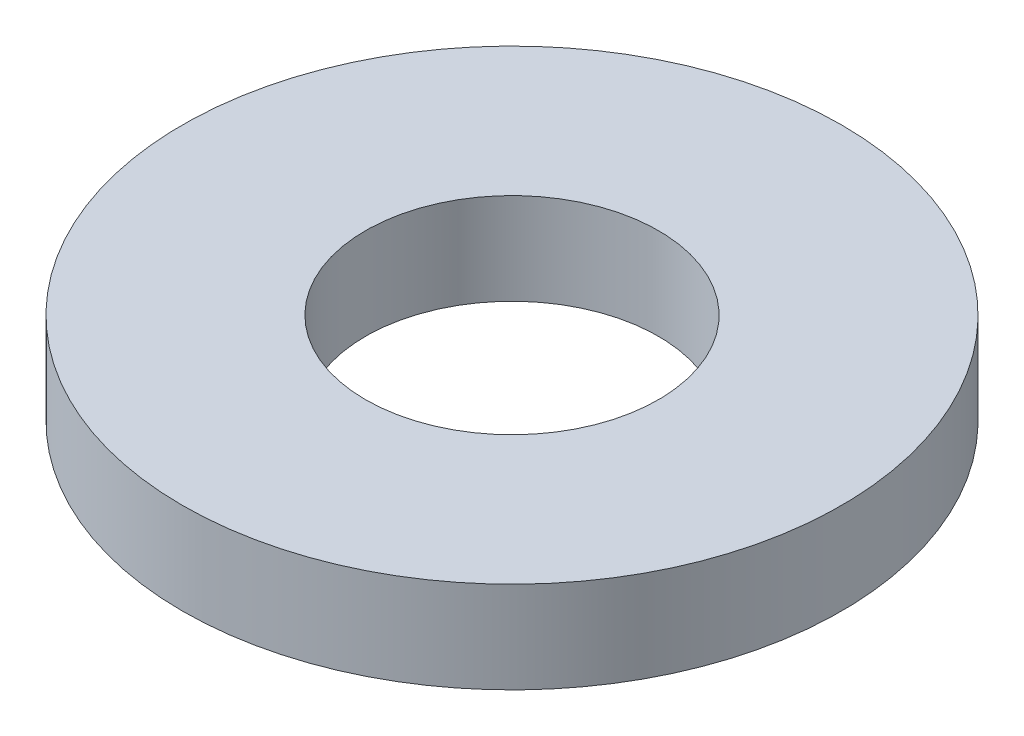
ISO-10303-21;
HEADER;
FILE_DESCRIPTION(('STEP AP214'),'2;1');
FILE_NAME('part.step','',(''),(''),'','','');
FILE_SCHEMA(('AUTOMOTIVE_DESIGN { 1 0 10303 214 1 1 1 1 }'));
ENDSEC;
DATA;
#1=APPLICATION_CONTEXT('core data for automotive mechanical design processes');
#2=APPLICATION_PROTOCOL_DEFINITION('international standard','automotive_design',2000,#1);
#3=PRODUCT_CONTEXT('',#1,'mechanical');
#4=PRODUCT('Part','Part','',(#3));
#5=PRODUCT_RELATED_PRODUCT_CATEGORY('part','',(#4));
#6=PRODUCT_DEFINITION_FORMATION('','',#4);
#7=PRODUCT_DEFINITION_CONTEXT('part definition',#1,'design');
#8=PRODUCT_DEFINITION('design','',#6,#7);
#9=PRODUCT_DEFINITION_SHAPE('','',#8);
#10=(LENGTH_UNIT() NAMED_UNIT(*) SI_UNIT(.MILLI.,.METRE.));
#11=(NAMED_UNIT(*) PLANE_ANGLE_UNIT() SI_UNIT($,.RADIAN.));
#12=(NAMED_UNIT(*) SI_UNIT($,.STERADIAN.) SOLID_ANGLE_UNIT());
#13=UNCERTAINTY_MEASURE_WITH_UNIT(LENGTH_MEASURE(1.E-05),#10,'distance_accuracy_value','');
#14=(GEOMETRIC_REPRESENTATION_CONTEXT(3) GLOBAL_UNCERTAINTY_ASSIGNED_CONTEXT((#13)) GLOBAL_UNIT_ASSIGNED_CONTEXT((#10,
#11,#12)) REPRESENTATION_CONTEXT('',''));
#15=CARTESIAN_POINT('',(0.,0.,0.));
#16=DIRECTION('',(0.,0.,1.));
#17=DIRECTION('',(1.,0.,0.));
#18=AXIS2_PLACEMENT_3D('',#15,#16,#17);
#19=CARTESIAN_POINT('',(0.,5.,0.));
#20=DIRECTION('',(0.,1.,0.));
#21=DIRECTION('',(0.,0.,1.));
#22=AXIS2_PLACEMENT_3D('',#19,#20,#21);
#23=PLANE('',#22);
#24=CARTESIAN_POINT('',(0.,5.,0.));
#25=DIRECTION('',(0.,1.,0.));
#26=DIRECTION('',(0.,0.,1.));
#27=AXIS2_PLACEMENT_3D('',#24,#25,#26);
#28=CIRCLE('',#27,18.);
#29=CARTESIAN_POINT('',(0.,5.,18.));
#30=VERTEX_POINT('',#29);
#31=EDGE_CURVE('E10',#30,#30,#28,.T.);
#32=ORIENTED_EDGE('',*,*,#31,.T.);
#33=EDGE_LOOP('',(#32));
#34=FACE_BOUND('',#33,.T.);
#35=CARTESIAN_POINT('',(0.,5.,0.));
#36=DIRECTION('',(0.,1.,0.));
#37=DIRECTION('',(0.,0.,1.));
#38=AXIS2_PLACEMENT_3D('',#35,#36,#37);
#39=CIRCLE('',#38,8.);
#40=CARTESIAN_POINT('',(0.,5.,8.));
#41=VERTEX_POINT('',#40);
#42=EDGE_CURVE('E42',#41,#41,#39,.T.);
#43=ORIENTED_EDGE('',*,*,#42,.F.);
#44=EDGE_LOOP('',(#43));
#45=FACE_BOUND('',#44,.T.);
#46=ADVANCED_FACE('F31',(#34,#45),#23,.T.);
#47=CARTESIAN_POINT('',(0.,0.,0.));
#48=DIRECTION('',(0.,1.,0.));
#49=DIRECTION('',(0.,0.,1.));
#50=AXIS2_PLACEMENT_3D('',#47,#48,#49);
#51=PLANE('',#50);
#52=CARTESIAN_POINT('',(0.,0.,0.));
#53=DIRECTION('',(0.,1.,0.));
#54=DIRECTION('',(0.,0.,1.));
#55=AXIS2_PLACEMENT_3D('',#52,#53,#54);
#56=CIRCLE('',#55,18.);
#57=CARTESIAN_POINT('',(0.,0.,18.));
#58=VERTEX_POINT('',#57);
#59=EDGE_CURVE('E35',#58,#58,#56,.T.);
#60=ORIENTED_EDGE('',*,*,#59,.F.);
#61=EDGE_LOOP('',(#60));
#62=FACE_BOUND('',#61,.T.);
#63=CARTESIAN_POINT('',(0.,0.,0.));
#64=DIRECTION('',(0.,1.,0.));
#65=DIRECTION('',(0.,0.,1.));
#66=AXIS2_PLACEMENT_3D('',#63,#64,#65);
#67=CIRCLE('',#66,8.);
#68=CARTESIAN_POINT('',(0.,0.,8.));
#69=VERTEX_POINT('',#68);
#70=EDGE_CURVE('E44',#69,#69,#67,.T.);
#71=ORIENTED_EDGE('',*,*,#70,.T.);
#72=EDGE_LOOP('',(#71));
#73=FACE_BOUND('',#72,.T.);
#74=ADVANCED_FACE('F54',(#62,#73),#51,.F.);
#75=CARTESIAN_POINT('',(0.,5.,0.));
#76=DIRECTION('',(0.,-1.,0.));
#77=DIRECTION('',(0.,0.,-1.));
#78=AXIS2_PLACEMENT_3D('',#75,#76,#77);
#79=CYLINDRICAL_SURFACE('',#78,18.);
#80=ORIENTED_EDGE('',*,*,#31,.F.);
#81=EDGE_LOOP('',(#80));
#82=FACE_BOUND('',#81,.T.);
#83=ORIENTED_EDGE('',*,*,#59,.T.);
#84=EDGE_LOOP('',(#83));
#85=FACE_BOUND('',#84,.T.);
#86=ADVANCED_FACE('F33',(#82,#85),#79,.T.);
#87=CARTESIAN_POINT('',(0.,5.,0.));
#88=DIRECTION('',(0.,-1.,0.));
#89=DIRECTION('',(0.,0.,-1.));
#90=AXIS2_PLACEMENT_3D('',#87,#88,#89);
#91=CYLINDRICAL_SURFACE('',#90,8.);
#92=ORIENTED_EDGE('',*,*,#42,.T.);
#93=EDGE_LOOP('',(#92));
#94=FACE_BOUND('',#93,.T.);
#95=ORIENTED_EDGE('',*,*,#70,.F.);
#96=EDGE_LOOP('',(#95));
#97=FACE_BOUND('',#96,.T.);
#98=ADVANCED_FACE('F50',(#94,#97),#91,.F.);
#99=CLOSED_SHELL('',(#46,#74,#86,#98));
#100=MANIFOLD_SOLID_BREP('B2',#99);
#101=ADVANCED_BREP_SHAPE_REPRESENTATION('',(#18,#100),#14);
#102=SHAPE_DEFINITION_REPRESENTATION(#9,#101);
ENDSEC;
END-ISO-10303-21;
